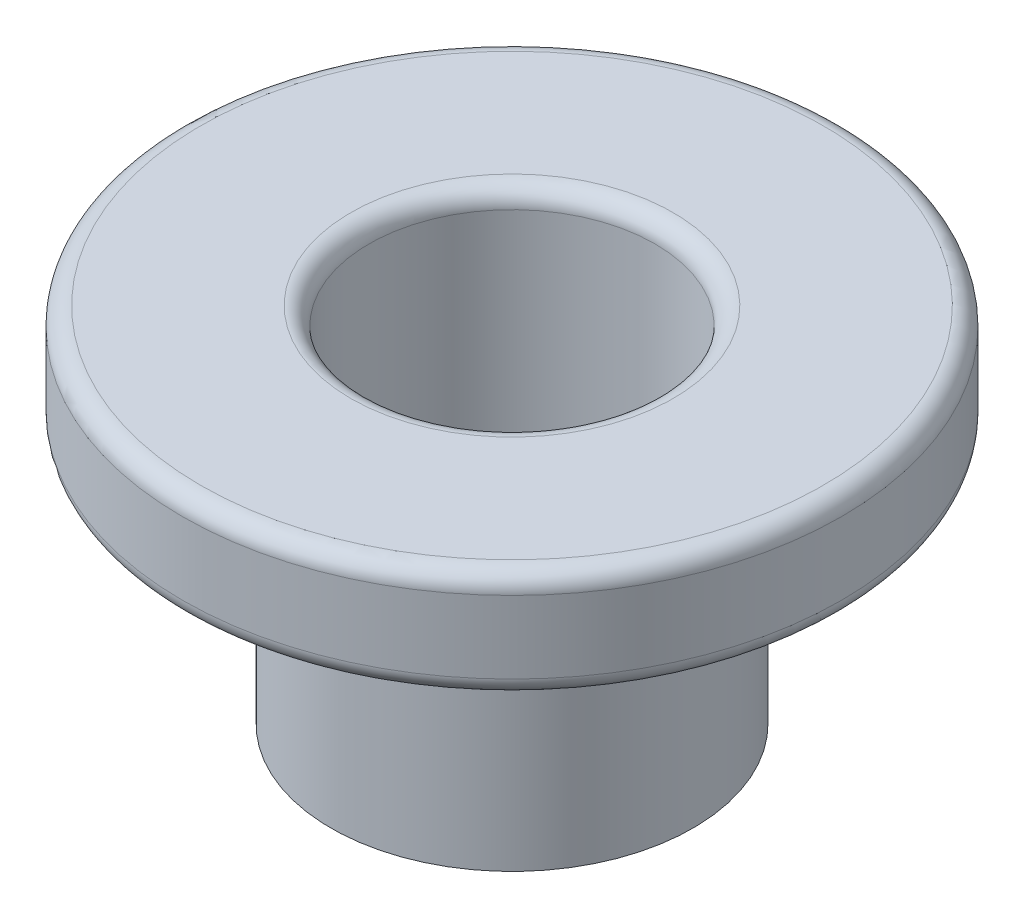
ISO-10303-21;
HEADER;
FILE_DESCRIPTION(('STEP AP214'),'2;1');
FILE_NAME('part.step','',(''),(''),'','','');
FILE_SCHEMA(('AUTOMOTIVE_DESIGN { 1 0 10303 214 1 1 1 1 }'));
ENDSEC;
DATA;
#1=APPLICATION_CONTEXT('core data for automotive mechanical design processes');
#2=APPLICATION_PROTOCOL_DEFINITION('international standard','automotive_design',2000,#1);
#3=PRODUCT_CONTEXT('',#1,'mechanical');
#4=PRODUCT('Part','Part','',(#3));
#5=PRODUCT_RELATED_PRODUCT_CATEGORY('part','',(#4));
#6=PRODUCT_DEFINITION_FORMATION('','',#4);
#7=PRODUCT_DEFINITION_CONTEXT('part definition',#1,'design');
#8=PRODUCT_DEFINITION('design','',#6,#7);
#9=PRODUCT_DEFINITION_SHAPE('','',#8);
#10=(LENGTH_UNIT() NAMED_UNIT(*) SI_UNIT(.MILLI.,.METRE.));
#11=(NAMED_UNIT(*) PLANE_ANGLE_UNIT() SI_UNIT($,.RADIAN.));
#12=(NAMED_UNIT(*) SI_UNIT($,.STERADIAN.) SOLID_ANGLE_UNIT());
#13=UNCERTAINTY_MEASURE_WITH_UNIT(LENGTH_MEASURE(1.E-05),#10,'distance_accuracy_value','');
#14=(GEOMETRIC_REPRESENTATION_CONTEXT(3) GLOBAL_UNCERTAINTY_ASSIGNED_CONTEXT((#13)) GLOBAL_UNIT_ASSIGNED_CONTEXT((#10,
#11,#12)) REPRESENTATION_CONTEXT('',''));
#15=CARTESIAN_POINT('',(0.,0.,0.));
#16=DIRECTION('',(0.,0.,1.));
#17=DIRECTION('',(1.,0.,0.));
#18=AXIS2_PLACEMENT_3D('',#15,#16,#17);
#19=CARTESIAN_POINT('',(2.54,0.,0.));
#20=DIRECTION('',(0.,-1.,0.));
#21=DIRECTION('',(0.,0.,-1.));
#22=AXIS2_PLACEMENT_3D('',#19,#20,#21);
#23=PLANE('',#22);
#24=CARTESIAN_POINT('',(0.,0.,0.));
#25=DIRECTION('',(0.,-1.,0.));
#26=DIRECTION('',(0.,0.,-1.));
#27=AXIS2_PLACEMENT_3D('',#24,#25,#26);
#28=CIRCLE('',#27,2.54);
#29=CARTESIAN_POINT('',(0.,0.,-2.54));
#30=VERTEX_POINT('',#29);
#31=EDGE_CURVE('E55',#30,#30,#28,.T.);
#32=ORIENTED_EDGE('',*,*,#31,.T.);
#33=EDGE_LOOP('',(#32));
#34=FACE_BOUND('',#33,.T.);
#35=CARTESIAN_POINT('',(0.,0.,0.));
#36=DIRECTION('',(0.,-1.,0.));
#37=DIRECTION('',(0.,0.,-1.));
#38=AXIS2_PLACEMENT_3D('',#35,#36,#37);
#39=CIRCLE('',#38,2.0066);
#40=CARTESIAN_POINT('',(0.,0.,-2.0066));
#41=VERTEX_POINT('',#40);
#42=EDGE_CURVE('E49',#41,#41,#39,.T.);
#43=ORIENTED_EDGE('',*,*,#42,.F.);
#44=EDGE_LOOP('',(#43));
#45=FACE_BOUND('',#44,.T.);
#46=ADVANCED_FACE('F24',(#34,#45),#23,.T.);
#47=CARTESIAN_POINT('',(0.,0.,0.));
#48=DIRECTION('',(0.,-1.,0.));
#49=DIRECTION('',(0.,0.,-1.));
#50=AXIS2_PLACEMENT_3D('',#47,#48,#49);
#51=CYLINDRICAL_SURFACE('',#50,2.0066);
#52=CARTESIAN_POINT('',(0.,4.826,0.));
#53=DIRECTION('',(0.,1.,0.));
#54=DIRECTION('',(0.,0.,1.));
#55=AXIS2_PLACEMENT_3D('',#52,#53,#54);
#56=CIRCLE('',#55,2.0066);
#57=CARTESIAN_POINT('',(0.,4.826,2.0066));
#58=VERTEX_POINT('',#57);
#59=EDGE_CURVE('E38',#58,#58,#56,.T.);
#60=ORIENTED_EDGE('',*,*,#59,.T.);
#61=EDGE_LOOP('',(#60));
#62=FACE_BOUND('',#61,.T.);
#63=ORIENTED_EDGE('',*,*,#42,.T.);
#64=EDGE_LOOP('',(#63));
#65=FACE_BOUND('',#64,.T.);
#66=ADVANCED_FACE('F79',(#62,#65),#51,.F.);
#67=CARTESIAN_POINT('',(2.0066,5.08,0.));
#68=DIRECTION('',(0.,1.,0.));
#69=DIRECTION('',(0.,0.,1.));
#70=AXIS2_PLACEMENT_3D('',#67,#68,#69);
#71=PLANE('',#70);
#72=CARTESIAN_POINT('',(0.,5.08,0.));
#73=DIRECTION('',(0.,1.,0.));
#74=DIRECTION('',(0.,0.,1.));
#75=AXIS2_PLACEMENT_3D('',#72,#73,#74);
#76=CIRCLE('',#75,2.2606);
#77=CARTESIAN_POINT('',(0.,5.08,2.2606));
#78=VERTEX_POINT('',#77);
#79=EDGE_CURVE('E43',#78,#78,#76,.F.);
#80=ORIENTED_EDGE('',*,*,#79,.T.);
#81=EDGE_LOOP('',(#80));
#82=FACE_BOUND('',#81,.T.);
#83=CARTESIAN_POINT('',(0.,5.08,0.));
#84=DIRECTION('',(0.,1.,0.));
#85=DIRECTION('',(0.,0.,1.));
#86=AXIS2_PLACEMENT_3D('',#83,#84,#85);
#87=CIRCLE('',#86,4.3688);
#88=CARTESIAN_POINT('',(0.,5.08,4.3688));
#89=VERTEX_POINT('',#88);
#90=EDGE_CURVE('E46',#89,#89,#87,.T.);
#91=ORIENTED_EDGE('',*,*,#90,.T.);
#92=EDGE_LOOP('',(#91));
#93=FACE_BOUND('',#92,.T.);
#94=ADVANCED_FACE('F82',(#82,#93),#71,.T.);
#95=CARTESIAN_POINT('',(0.,0.,0.));
#96=DIRECTION('',(0.,-1.,0.));
#97=DIRECTION('',(0.,0.,-1.));
#98=AXIS2_PLACEMENT_3D('',#95,#96,#97);
#99=CYLINDRICAL_SURFACE('',#98,4.6228);
#100=CARTESIAN_POINT('',(0.,3.81,0.));
#101=DIRECTION('',(0.,-1.,0.));
#102=DIRECTION('',(0.,0.,-1.));
#103=AXIS2_PLACEMENT_3D('',#100,#101,#102);
#104=CIRCLE('',#103,4.6228);
#105=CARTESIAN_POINT('',(0.,3.81,-4.6228));
#106=VERTEX_POINT('',#105);
#107=EDGE_CURVE('E10',#106,#106,#104,.F.);
#108=ORIENTED_EDGE('',*,*,#107,.T.);
#109=EDGE_LOOP('',(#108));
#110=FACE_BOUND('',#109,.T.);
#111=CARTESIAN_POINT('',(0.,4.826,0.));
#112=DIRECTION('',(0.,1.,0.));
#113=DIRECTION('',(0.,0.,1.));
#114=AXIS2_PLACEMENT_3D('',#111,#112,#113);
#115=CIRCLE('',#114,4.6228);
#116=CARTESIAN_POINT('',(0.,4.826,4.6228));
#117=VERTEX_POINT('',#116);
#118=EDGE_CURVE('E30',#117,#117,#115,.F.);
#119=ORIENTED_EDGE('',*,*,#118,.T.);
#120=EDGE_LOOP('',(#119));
#121=FACE_BOUND('',#120,.T.);
#122=ADVANCED_FACE('F76',(#110,#121),#99,.T.);
#123=CARTESIAN_POINT('',(4.6228,3.556,0.));
#124=DIRECTION('',(0.,-1.,0.));
#125=DIRECTION('',(0.,0.,-1.));
#126=AXIS2_PLACEMENT_3D('',#123,#124,#125);
#127=PLANE('',#126);
#128=CARTESIAN_POINT('',(0.,3.556,0.));
#129=DIRECTION('',(0.,-1.,0.));
#130=DIRECTION('',(0.,0.,-1.));
#131=AXIS2_PLACEMENT_3D('',#128,#129,#130);
#132=CIRCLE('',#131,4.3688);
#133=CARTESIAN_POINT('',(0.,3.556,-4.3688));
#134=VERTEX_POINT('',#133);
#135=EDGE_CURVE('E34',#134,#134,#132,.T.);
#136=ORIENTED_EDGE('',*,*,#135,.T.);
#137=EDGE_LOOP('',(#136));
#138=FACE_BOUND('',#137,.T.);
#139=CARTESIAN_POINT('',(0.,3.556,0.));
#140=DIRECTION('',(0.,-1.,0.));
#141=DIRECTION('',(0.,0.,-1.));
#142=AXIS2_PLACEMENT_3D('',#139,#140,#141);
#143=CIRCLE('',#142,2.54);
#144=CARTESIAN_POINT('',(0.,3.556,-2.54));
#145=VERTEX_POINT('',#144);
#146=EDGE_CURVE('E52',#145,#145,#143,.T.);
#147=ORIENTED_EDGE('',*,*,#146,.F.);
#148=EDGE_LOOP('',(#147));
#149=FACE_BOUND('',#148,.T.);
#150=ADVANCED_FACE('F64',(#138,#149),#127,.T.);
#151=CARTESIAN_POINT('',(0.,0.,0.));
#152=DIRECTION('',(0.,-1.,0.));
#153=DIRECTION('',(0.,0.,-1.));
#154=AXIS2_PLACEMENT_3D('',#151,#152,#153);
#155=CYLINDRICAL_SURFACE('',#154,2.54);
#156=ORIENTED_EDGE('',*,*,#146,.T.);
#157=EDGE_LOOP('',(#156));
#158=FACE_BOUND('',#157,.T.);
#159=ORIENTED_EDGE('',*,*,#31,.F.);
#160=EDGE_LOOP('',(#159));
#161=FACE_BOUND('',#160,.T.);
#162=ADVANCED_FACE('F61',(#158,#161),#155,.T.);
#163=CARTESIAN_POINT('',(0.,4.826,0.));
#164=DIRECTION('',(0.,1.,0.));
#165=DIRECTION('',(0.,0.,1.));
#166=AXIS2_PLACEMENT_3D('',#163,#164,#165);
#167=TOROIDAL_SURFACE('',#166,2.2606,0.254);
#168=ORIENTED_EDGE('',*,*,#59,.F.);
#169=EDGE_LOOP('',(#168));
#170=FACE_BOUND('',#169,.T.);
#171=ORIENTED_EDGE('',*,*,#79,.F.);
#172=EDGE_LOOP('',(#171));
#173=FACE_BOUND('',#172,.T.);
#174=ADVANCED_FACE('F63',(#170,#173),#167,.T.);
#175=CARTESIAN_POINT('',(0.,3.81,0.));
#176=DIRECTION('',(0.,-1.,0.));
#177=DIRECTION('',(0.,0.,-1.));
#178=AXIS2_PLACEMENT_3D('',#175,#176,#177);
#179=TOROIDAL_SURFACE('',#178,4.3688,0.254);
#180=ORIENTED_EDGE('',*,*,#107,.F.);
#181=EDGE_LOOP('',(#180));
#182=FACE_BOUND('',#181,.T.);
#183=ORIENTED_EDGE('',*,*,#135,.F.);
#184=EDGE_LOOP('',(#183));
#185=FACE_BOUND('',#184,.T.);
#186=ADVANCED_FACE('F72',(#182,#185),#179,.T.);
#187=CARTESIAN_POINT('',(0.,4.826,0.));
#188=DIRECTION('',(0.,1.,0.));
#189=DIRECTION('',(0.,0.,1.));
#190=AXIS2_PLACEMENT_3D('',#187,#188,#189);
#191=TOROIDAL_SURFACE('',#190,4.3688,0.254);
#192=ORIENTED_EDGE('',*,*,#90,.F.);
#193=EDGE_LOOP('',(#192));
#194=FACE_BOUND('',#193,.T.);
#195=ORIENTED_EDGE('',*,*,#118,.F.);
#196=EDGE_LOOP('',(#195));
#197=FACE_BOUND('',#196,.T.);
#198=ADVANCED_FACE('F110',(#194,#197),#191,.T.);
#199=CLOSED_SHELL('',(#46,#66,#94,#122,#150,#162,#174,#186,#198));
#200=MANIFOLD_SOLID_BREP('B2',#199);
#201=ADVANCED_BREP_SHAPE_REPRESENTATION('',(#18,#200),#14);
#202=SHAPE_DEFINITION_REPRESENTATION(#9,#201);
ENDSEC;
END-ISO-10303-21;
